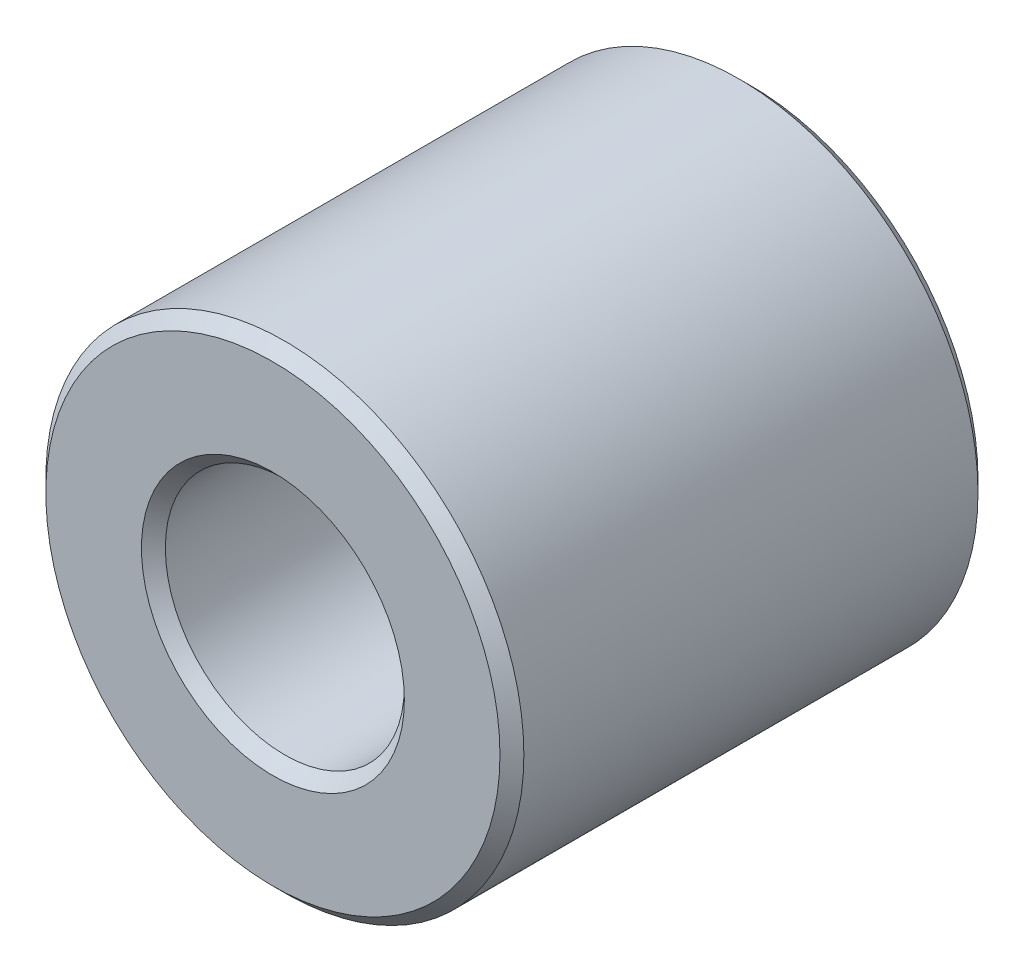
from build123d import *

# Parameters (mm, degrees)
SKETCH1_R           = 40
SKETCH1_R_2         = 20
BOSS_EXTRUDE1_DEPTH = 40
CHAMFER1_SIZE       = 2


with BuildPart() as part:
    # Sketch1 → Boss-Extrude1 (new, symmetric)
    with BuildSketch(Plane.XY):
        Circle(SKETCH1_R)
        Circle(SKETCH1_R_2, mode=Mode.SUBTRACT)
    extrude(amount=BOSS_EXTRUDE1_DEPTH, both=True)

    # Chamfer1
    chamfer1_edges = [part.edges().sort_by_distance(p)[0] for p in [
        (-40, 0, -40),
        (-40, 0, 40),
        (-20, 0, -40),
        (-20, 0, 40),
    ]]
    chamfer(chamfer1_edges, length=CHAMFER1_SIZE)


solid = part.part
